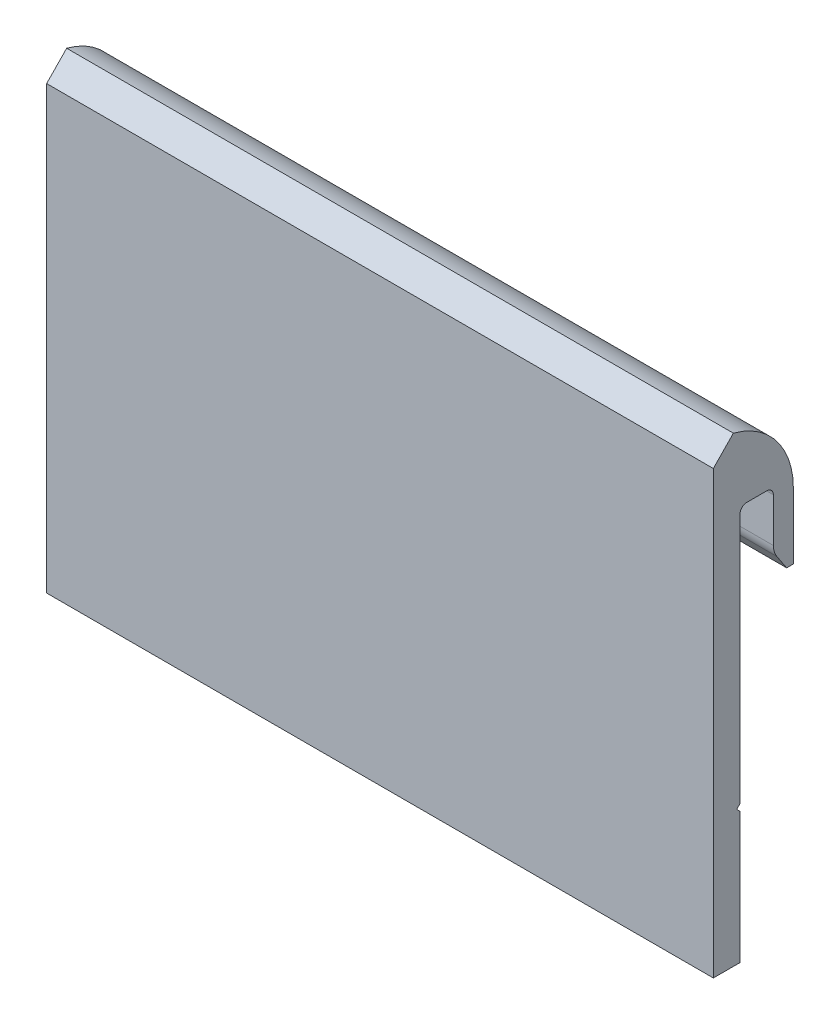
ISO-10303-21;
HEADER;
FILE_DESCRIPTION(('STEP AP214'),'2;1');
FILE_NAME('part.step','',(''),(''),'','','');
FILE_SCHEMA(('AUTOMOTIVE_DESIGN { 1 0 10303 214 1 1 1 1 }'));
ENDSEC;
DATA;
#1=APPLICATION_CONTEXT('core data for automotive mechanical design processes');
#2=APPLICATION_PROTOCOL_DEFINITION('international standard','automotive_design',2000,#1);
#3=PRODUCT_CONTEXT('',#1,'mechanical');
#4=PRODUCT('Part','Part','',(#3));
#5=PRODUCT_RELATED_PRODUCT_CATEGORY('part','',(#4));
#6=PRODUCT_DEFINITION_FORMATION('','',#4);
#7=PRODUCT_DEFINITION_CONTEXT('part definition',#1,'design');
#8=PRODUCT_DEFINITION('design','',#6,#7);
#9=PRODUCT_DEFINITION_SHAPE('','',#8);
#10=(LENGTH_UNIT() NAMED_UNIT(*) SI_UNIT(.MILLI.,.METRE.));
#11=(NAMED_UNIT(*) PLANE_ANGLE_UNIT() SI_UNIT($,.RADIAN.));
#12=(NAMED_UNIT(*) SI_UNIT($,.STERADIAN.) SOLID_ANGLE_UNIT());
#13=UNCERTAINTY_MEASURE_WITH_UNIT(LENGTH_MEASURE(1.E-05),#10,'distance_accuracy_value','');
#14=(GEOMETRIC_REPRESENTATION_CONTEXT(3) GLOBAL_UNCERTAINTY_ASSIGNED_CONTEXT((#13)) GLOBAL_UNIT_ASSIGNED_CONTEXT((#10,
#11,#12)) REPRESENTATION_CONTEXT('',''));
#15=CARTESIAN_POINT('',(0.,0.,0.));
#16=DIRECTION('',(0.,0.,1.));
#17=DIRECTION('',(1.,0.,0.));
#18=AXIS2_PLACEMENT_3D('',#15,#16,#17);
#19=CARTESIAN_POINT('',(-50.,130.205977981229,-0.821931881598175));
#20=DIRECTION('',(0.,0.,-1.));
#21=DIRECTION('',(0.,1.,0.));
#22=AXIS2_PLACEMENT_3D('',#19,#20,#21);
#23=PLANE('',#22);
#24=DIRECTION('',(0.,1.,0.));
#25=VECTOR('',#24,1.);
#26=CARTESIAN_POINT('',(50.,130.205977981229,-0.821931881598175));
#27=LINE('',#26,#25);
#28=CARTESIAN_POINT('',(50.,64.0209864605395,-0.821931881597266));
#29=VERTEX_POINT('',#28);
#30=CARTESIAN_POINT('',(50.,130.205977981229,-0.821931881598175));
#31=VERTEX_POINT('',#30);
#32=EDGE_CURVE('E176',#29,#31,#27,.T.);
#33=ORIENTED_EDGE('',*,*,#32,.T.);
#34=DIRECTION('',(1.,0.,0.));
#35=VECTOR('',#34,1.);
#36=CARTESIAN_POINT('',(-50.,130.205977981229,-0.821931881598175));
#37=LINE('',#36,#35);
#38=CARTESIAN_POINT('',(-50.,130.205977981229,-0.821931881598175));
#39=VERTEX_POINT('',#38);
#40=EDGE_CURVE('E11',#39,#31,#37,.T.);
#41=ORIENTED_EDGE('',*,*,#40,.F.);
#42=DIRECTION('',(0.,1.,0.));
#43=VECTOR('',#42,1.);
#44=CARTESIAN_POINT('',(-50.,130.205977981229,-0.821931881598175));
#45=LINE('',#44,#43);
#46=CARTESIAN_POINT('',(-50.,64.0209864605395,-0.821931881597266));
#47=VERTEX_POINT('',#46);
#48=EDGE_CURVE('E206',#47,#39,#45,.T.);
#49=ORIENTED_EDGE('',*,*,#48,.F.);
#50=DIRECTION('',(1.,0.,0.));
#51=VECTOR('',#50,1.);
#52=CARTESIAN_POINT('',(-50.,64.0209864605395,-0.821931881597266));
#53=LINE('',#52,#51);
#54=EDGE_CURVE('E172',#47,#29,#53,.T.);
#55=ORIENTED_EDGE('',*,*,#54,.T.);
#56=EDGE_LOOP('',(#33,#41,#49,#55));
#57=FACE_BOUND('',#56,.T.);
#58=ADVANCED_FACE('F32',(#57),#23,.F.);
#59=CARTESIAN_POINT('',(-50.,133.294066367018,-3.82193188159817));
#60=DIRECTION('',(0.,-0.69680273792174,-0.717262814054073));
#61=DIRECTION('',(0.,0.717262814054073,-0.69680273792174));
#62=AXIS2_PLACEMENT_3D('',#59,#60,#61);
#63=PLANE('',#62);
#64=DIRECTION('',(0.,0.717262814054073,-0.69680273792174));
#65=VECTOR('',#64,1.);
#66=CARTESIAN_POINT('',(50.,133.294066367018,-3.82193188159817));
#67=LINE('',#66,#65);
#68=CARTESIAN_POINT('',(50.,133.294066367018,-3.82193188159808));
#69=VERTEX_POINT('',#68);
#70=EDGE_CURVE('E179',#31,#69,#67,.T.);
#71=ORIENTED_EDGE('',*,*,#70,.T.);
#72=DIRECTION('',(1.,0.,0.));
#73=VECTOR('',#72,1.);
#74=CARTESIAN_POINT('',(-50.,133.294066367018,-3.82193188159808));
#75=LINE('',#74,#73);
#76=CARTESIAN_POINT('',(-50.,133.294066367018,-3.82193188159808));
#77=VERTEX_POINT('',#76);
#78=EDGE_CURVE('E40',#77,#69,#75,.T.);
#79=ORIENTED_EDGE('',*,*,#78,.F.);
#80=DIRECTION('',(0.,0.717262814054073,-0.69680273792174));
#81=VECTOR('',#80,1.);
#82=CARTESIAN_POINT('',(-50.,133.294066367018,-3.82193188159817));
#83=LINE('',#82,#81);
#84=EDGE_CURVE('E115',#39,#77,#83,.T.);
#85=ORIENTED_EDGE('',*,*,#84,.F.);
#86=ORIENTED_EDGE('',*,*,#40,.T.);
#87=EDGE_LOOP('',(#71,#79,#85,#86));
#88=FACE_BOUND('',#87,.T.);
#89=ADVANCED_FACE('F304',(#88),#63,.F.);
#90=CARTESIAN_POINT('',(-50.,121.675116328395,-0.821931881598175));
#91=DIRECTION('',(1.,0.,0.));
#92=DIRECTION('',(0.,0.,-1.));
#93=AXIS2_PLACEMENT_3D('',#90,#91,#92);
#94=CYLINDRICAL_SURFACE('',#93,12.0000000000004);
#95=CARTESIAN_POINT('',(50.,121.675116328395,-0.821931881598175));
#96=DIRECTION('',(-1.,0.,0.));
#97=DIRECTION('',(0.,0.,1.));
#98=AXIS2_PLACEMENT_3D('',#95,#96,#97);
#99=CIRCLE('',#98,12.0000000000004);
#100=CARTESIAN_POINT('',(50.,121.675116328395,-12.8219318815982));
#101=VERTEX_POINT('',#100);
#102=EDGE_CURVE('E181',#69,#101,#99,.T.);
#103=ORIENTED_EDGE('',*,*,#102,.T.);
#104=DIRECTION('',(1.,0.,0.));
#105=VECTOR('',#104,1.);
#106=CARTESIAN_POINT('',(-50.,121.675116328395,-12.8219318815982));
#107=LINE('',#106,#105);
#108=CARTESIAN_POINT('',(-50.,121.675116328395,-12.8219318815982));
#109=VERTEX_POINT('',#108);
#110=EDGE_CURVE('E237',#109,#101,#107,.T.);
#111=ORIENTED_EDGE('',*,*,#110,.F.);
#112=CARTESIAN_POINT('',(-50.,121.675116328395,-0.821931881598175));
#113=DIRECTION('',(-1.,0.,0.));
#114=DIRECTION('',(0.,0.,1.));
#115=AXIS2_PLACEMENT_3D('',#112,#113,#114);
#116=CIRCLE('',#115,12.0000000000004);
#117=EDGE_CURVE('E245',#77,#109,#116,.T.);
#118=ORIENTED_EDGE('',*,*,#117,.F.);
#119=ORIENTED_EDGE('',*,*,#78,.T.);
#120=EDGE_LOOP('',(#103,#111,#118,#119));
#121=FACE_BOUND('',#120,.T.);
#122=ADVANCED_FACE('F243',(#121),#94,.T.);
#123=CARTESIAN_POINT('',(-50.,121.675116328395,-12.8219318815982));
#124=DIRECTION('',(0.,0.,1.));
#125=DIRECTION('',(1.,0.,0.));
#126=AXIS2_PLACEMENT_3D('',#123,#124,#125);
#127=PLANE('',#126);
#128=DIRECTION('',(0.,-1.,0.));
#129=VECTOR('',#128,1.);
#130=CARTESIAN_POINT('',(50.,121.675116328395,-12.8219318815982));
#131=LINE('',#130,#129);
#132=CARTESIAN_POINT('',(50.,111.794066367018,-12.8219318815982));
#133=VERTEX_POINT('',#132);
#134=EDGE_CURVE('E183',#101,#133,#131,.T.);
#135=ORIENTED_EDGE('',*,*,#134,.T.);
#136=DIRECTION('',(1.,0.,0.));
#137=VECTOR('',#136,1.);
#138=CARTESIAN_POINT('',(-50.,111.794066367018,-12.8219318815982));
#139=LINE('',#138,#137);
#140=CARTESIAN_POINT('',(-50.,111.794066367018,-12.8219318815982));
#141=VERTEX_POINT('',#140);
#142=EDGE_CURVE('E234',#141,#133,#139,.T.);
#143=ORIENTED_EDGE('',*,*,#142,.F.);
#144=DIRECTION('',(0.,-1.,0.));
#145=VECTOR('',#144,1.);
#146=CARTESIAN_POINT('',(-50.,121.675116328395,-12.8219318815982));
#147=LINE('',#146,#145);
#148=EDGE_CURVE('E263',#109,#141,#147,.T.);
#149=ORIENTED_EDGE('',*,*,#148,.F.);
#150=ORIENTED_EDGE('',*,*,#110,.T.);
#151=EDGE_LOOP('',(#135,#143,#149,#150));
#152=FACE_BOUND('',#151,.T.);
#153=ADVANCED_FACE('F254',(#152),#127,.F.);
#154=CARTESIAN_POINT('',(-50.,111.794066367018,-12.8219318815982));
#155=DIRECTION('',(0.,1.,0.));
#156=DIRECTION('',(0.,0.,1.));
#157=AXIS2_PLACEMENT_3D('',#154,#155,#156);
#158=PLANE('',#157);
#159=DIRECTION('',(0.,0.,1.));
#160=VECTOR('',#159,1.);
#161=CARTESIAN_POINT('',(50.,111.794066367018,-12.8219318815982));
#162=LINE('',#161,#160);
#163=CARTESIAN_POINT('',(50.,111.794066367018,-11.8219318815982));
#164=VERTEX_POINT('',#163);
#165=EDGE_CURVE('E185',#133,#164,#162,.T.);
#166=ORIENTED_EDGE('',*,*,#165,.T.);
#167=DIRECTION('',(1.,0.,0.));
#168=VECTOR('',#167,1.);
#169=CARTESIAN_POINT('',(-50.,111.794066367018,-11.8219318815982));
#170=LINE('',#169,#168);
#171=CARTESIAN_POINT('',(-50.,111.794066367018,-11.8219318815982));
#172=VERTEX_POINT('',#171);
#173=EDGE_CURVE('E231',#172,#164,#170,.T.);
#174=ORIENTED_EDGE('',*,*,#173,.F.);
#175=DIRECTION('',(0.,0.,1.));
#176=VECTOR('',#175,1.);
#177=CARTESIAN_POINT('',(-50.,111.794066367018,-12.8219318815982));
#178=LINE('',#177,#176);
#179=EDGE_CURVE('E260',#141,#172,#178,.T.);
#180=ORIENTED_EDGE('',*,*,#179,.F.);
#181=ORIENTED_EDGE('',*,*,#142,.T.);
#182=EDGE_LOOP('',(#166,#174,#180,#181));
#183=FACE_BOUND('',#182,.T.);
#184=ADVANCED_FACE('F258',(#183),#158,.F.);
#185=CARTESIAN_POINT('',(-50.,111.794066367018,-11.8219318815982));
#186=DIRECTION('',(0.,0.554700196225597,-0.832050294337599));
#187=DIRECTION('',(0.,0.832050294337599,0.554700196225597));
#188=AXIS2_PLACEMENT_3D('',#185,#186,#187);
#189=PLANE('',#188);
#190=DIRECTION('',(0.,0.832050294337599,0.554700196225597));
#191=VECTOR('',#190,1.);
#192=CARTESIAN_POINT('',(50.,111.794066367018,-11.8219318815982));
#193=LINE('',#192,#191);
#194=CARTESIAN_POINT('',(50.,114.038292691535,-10.3257809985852));
#195=VERTEX_POINT('',#194);
#196=EDGE_CURVE('E187',#164,#195,#193,.T.);
#197=ORIENTED_EDGE('',*,*,#196,.T.);
#198=DIRECTION('',(1.,0.,0.));
#199=VECTOR('',#198,1.);
#200=CARTESIAN_POINT('',(-50.,114.038292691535,-10.3257809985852));
#201=LINE('',#200,#199);
#202=CARTESIAN_POINT('',(-50.,114.038292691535,-10.3257809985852));
#203=VERTEX_POINT('',#202);
#204=EDGE_CURVE('E228',#203,#195,#201,.T.);
#205=ORIENTED_EDGE('',*,*,#204,.F.);
#206=DIRECTION('',(0.,0.832050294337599,0.554700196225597));
#207=VECTOR('',#206,1.);
#208=CARTESIAN_POINT('',(-50.,111.794066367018,-11.8219318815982));
#209=LINE('',#208,#207);
#210=EDGE_CURVE('E262',#172,#203,#209,.T.);
#211=ORIENTED_EDGE('',*,*,#210,.F.);
#212=ORIENTED_EDGE('',*,*,#173,.T.);
#213=EDGE_LOOP('',(#197,#205,#211,#212));
#214=FACE_BOUND('',#213,.T.);
#215=ADVANCED_FACE('F317',(#214),#189,.F.);
#216=CARTESIAN_POINT('',(-50.,115.702393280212,-12.8219318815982));
#217=DIRECTION('',(1.,0.,0.));
#218=DIRECTION('',(0.,0.,-1.));
#219=AXIS2_PLACEMENT_3D('',#216,#217,#218);
#220=CYLINDRICAL_SURFACE('',#219,3.);
#221=CARTESIAN_POINT('',(50.,115.702393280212,-12.8219318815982));
#222=DIRECTION('',(-1.,0.,0.));
#223=DIRECTION('',(0.,0.,1.));
#224=AXIS2_PLACEMENT_3D('',#221,#222,#223);
#225=CIRCLE('',#224,3.);
#226=CARTESIAN_POINT('',(50.,115.702393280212,-9.82193188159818));
#227=VERTEX_POINT('',#226);
#228=EDGE_CURVE('E189',#195,#227,#225,.T.);
#229=ORIENTED_EDGE('',*,*,#228,.T.);
#230=DIRECTION('',(1.,0.,0.));
#231=VECTOR('',#230,1.);
#232=CARTESIAN_POINT('',(-50.,115.702393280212,-9.82193188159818));
#233=LINE('',#232,#231);
#234=CARTESIAN_POINT('',(-50.,115.702393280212,-9.82193188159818));
#235=VERTEX_POINT('',#234);
#236=EDGE_CURVE('E225',#235,#227,#233,.T.);
#237=ORIENTED_EDGE('',*,*,#236,.F.);
#238=CARTESIAN_POINT('',(-50.,115.702393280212,-12.8219318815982));
#239=DIRECTION('',(-1.,0.,0.));
#240=DIRECTION('',(0.,0.,1.));
#241=AXIS2_PLACEMENT_3D('',#238,#239,#240);
#242=CIRCLE('',#241,3.);
#243=EDGE_CURVE('E265',#203,#235,#242,.T.);
#244=ORIENTED_EDGE('',*,*,#243,.F.);
#245=ORIENTED_EDGE('',*,*,#204,.T.);
#246=EDGE_LOOP('',(#229,#237,#244,#245));
#247=FACE_BOUND('',#246,.T.);
#248=ADVANCED_FACE('F320',(#247),#220,.T.);
#249=CARTESIAN_POINT('',(-50.,122.294066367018,-9.82193188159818));
#250=DIRECTION('',(0.,0.,-1.));
#251=DIRECTION('',(-1.,0.,0.));
#252=AXIS2_PLACEMENT_3D('',#249,#250,#251);
#253=PLANE('',#252);
#254=DIRECTION('',(0.,1.,0.));
#255=VECTOR('',#254,1.);
#256=CARTESIAN_POINT('',(50.,122.294066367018,-9.82193188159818));
#257=LINE('',#256,#255);
#258=CARTESIAN_POINT('',(50.,122.294066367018,-9.82193188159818));
#259=VERTEX_POINT('',#258);
#260=EDGE_CURVE('E191',#227,#259,#257,.T.);
#261=ORIENTED_EDGE('',*,*,#260,.T.);
#262=DIRECTION('',(1.,0.,0.));
#263=VECTOR('',#262,1.);
#264=CARTESIAN_POINT('',(-50.,122.294066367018,-9.82193188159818));
#265=LINE('',#264,#263);
#266=CARTESIAN_POINT('',(-50.,122.294066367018,-9.82193188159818));
#267=VERTEX_POINT('',#266);
#268=EDGE_CURVE('E222',#267,#259,#265,.T.);
#269=ORIENTED_EDGE('',*,*,#268,.F.);
#270=DIRECTION('',(0.,1.,0.));
#271=VECTOR('',#270,1.);
#272=CARTESIAN_POINT('',(-50.,122.294066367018,-9.82193188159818));
#273=LINE('',#272,#271);
#274=EDGE_CURVE('E271',#235,#267,#273,.T.);
#275=ORIENTED_EDGE('',*,*,#274,.F.);
#276=ORIENTED_EDGE('',*,*,#236,.T.);
#277=EDGE_LOOP('',(#261,#269,#275,#276));
#278=FACE_BOUND('',#277,.T.);
#279=ADVANCED_FACE('F324',(#278),#253,.F.);
#280=CARTESIAN_POINT('',(-50.,122.294066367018,-8.82193188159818));
#281=DIRECTION('',(1.,0.,0.));
#282=DIRECTION('',(0.,0.,-1.));
#283=AXIS2_PLACEMENT_3D('',#280,#281,#282);
#284=CYLINDRICAL_SURFACE('',#283,1.);
#285=CARTESIAN_POINT('',(50.,122.294066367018,-8.82193188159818));
#286=DIRECTION('',(1.,0.,0.));
#287=DIRECTION('',(0.,0.,1.));
#288=AXIS2_PLACEMENT_3D('',#285,#286,#287);
#289=CIRCLE('',#288,1.);
#290=CARTESIAN_POINT('',(50.,123.294066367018,-8.82193188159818));
#291=VERTEX_POINT('',#290);
#292=EDGE_CURVE('E193',#259,#291,#289,.T.);
#293=ORIENTED_EDGE('',*,*,#292,.T.);
#294=DIRECTION('',(1.,0.,0.));
#295=VECTOR('',#294,1.);
#296=CARTESIAN_POINT('',(-50.,123.294066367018,-8.82193188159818));
#297=LINE('',#296,#295);
#298=CARTESIAN_POINT('',(-50.,123.294066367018,-8.82193188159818));
#299=VERTEX_POINT('',#298);
#300=EDGE_CURVE('E219',#299,#291,#297,.T.);
#301=ORIENTED_EDGE('',*,*,#300,.F.);
#302=CARTESIAN_POINT('',(-50.,122.294066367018,-8.82193188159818));
#303=DIRECTION('',(1.,0.,0.));
#304=DIRECTION('',(0.,0.,1.));
#305=AXIS2_PLACEMENT_3D('',#302,#303,#304);
#306=CIRCLE('',#305,1.);
#307=EDGE_CURVE('E273',#267,#299,#306,.T.);
#308=ORIENTED_EDGE('',*,*,#307,.F.);
#309=ORIENTED_EDGE('',*,*,#268,.T.);
#310=EDGE_LOOP('',(#293,#301,#308,#309));
#311=FACE_BOUND('',#310,.T.);
#312=ADVANCED_FACE('F328',(#311),#284,.F.);
#313=CARTESIAN_POINT('',(-50.,123.294066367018,-5.82193188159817));
#314=DIRECTION('',(0.,1.,0.));
#315=DIRECTION('',(0.,0.,1.));
#316=AXIS2_PLACEMENT_3D('',#313,#314,#315);
#317=PLANE('',#316);
#318=DIRECTION('',(0.,0.,1.));
#319=VECTOR('',#318,1.);
#320=CARTESIAN_POINT('',(50.,123.294066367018,-5.82193188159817));
#321=LINE('',#320,#319);
#322=CARTESIAN_POINT('',(50.,123.294066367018,-5.82193188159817));
#323=VERTEX_POINT('',#322);
#324=EDGE_CURVE('E195',#291,#323,#321,.T.);
#325=ORIENTED_EDGE('',*,*,#324,.T.);
#326=DIRECTION('',(1.,0.,0.));
#327=VECTOR('',#326,1.);
#328=CARTESIAN_POINT('',(-50.,123.294066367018,-5.82193188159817));
#329=LINE('',#328,#327);
#330=CARTESIAN_POINT('',(-50.,123.294066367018,-5.82193188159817));
#331=VERTEX_POINT('',#330);
#332=EDGE_CURVE('E216',#331,#323,#329,.T.);
#333=ORIENTED_EDGE('',*,*,#332,.F.);
#334=DIRECTION('',(0.,0.,1.));
#335=VECTOR('',#334,1.);
#336=CARTESIAN_POINT('',(-50.,123.294066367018,-5.82193188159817));
#337=LINE('',#336,#335);
#338=EDGE_CURVE('E275',#299,#331,#337,.T.);
#339=ORIENTED_EDGE('',*,*,#338,.F.);
#340=ORIENTED_EDGE('',*,*,#300,.T.);
#341=EDGE_LOOP('',(#325,#333,#339,#340));
#342=FACE_BOUND('',#341,.T.);
#343=ADVANCED_FACE('F332',(#342),#317,.F.);
#344=CARTESIAN_POINT('',(-50.,122.294066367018,-5.82193188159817));
#345=DIRECTION('',(1.,0.,0.));
#346=DIRECTION('',(0.,0.,-1.));
#347=AXIS2_PLACEMENT_3D('',#344,#345,#346);
#348=CYLINDRICAL_SURFACE('',#347,1.);
#349=CARTESIAN_POINT('',(50.,122.294066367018,-5.82193188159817));
#350=DIRECTION('',(1.,0.,0.));
#351=DIRECTION('',(0.,0.,1.));
#352=AXIS2_PLACEMENT_3D('',#349,#350,#351);
#353=CIRCLE('',#352,1.);
#354=CARTESIAN_POINT('',(50.,122.294066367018,-4.82193188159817));
#355=VERTEX_POINT('',#354);
#356=EDGE_CURVE('E197',#323,#355,#353,.T.);
#357=ORIENTED_EDGE('',*,*,#356,.T.);
#358=DIRECTION('',(1.,0.,0.));
#359=VECTOR('',#358,1.);
#360=CARTESIAN_POINT('',(-50.,122.294066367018,-4.82193188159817));
#361=LINE('',#360,#359);
#362=CARTESIAN_POINT('',(-50.,122.294066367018,-4.82193188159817));
#363=VERTEX_POINT('',#362);
#364=EDGE_CURVE('E213',#363,#355,#361,.T.);
#365=ORIENTED_EDGE('',*,*,#364,.F.);
#366=CARTESIAN_POINT('',(-50.,122.294066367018,-5.82193188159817));
#367=DIRECTION('',(1.,0.,0.));
#368=DIRECTION('',(0.,0.,1.));
#369=AXIS2_PLACEMENT_3D('',#366,#367,#368);
#370=CIRCLE('',#369,1.);
#371=EDGE_CURVE('E277',#331,#363,#370,.T.);
#372=ORIENTED_EDGE('',*,*,#371,.F.);
#373=ORIENTED_EDGE('',*,*,#332,.T.);
#374=EDGE_LOOP('',(#357,#365,#372,#373));
#375=FACE_BOUND('',#374,.T.);
#376=ADVANCED_FACE('F336',(#375),#348,.F.);
#377=CARTESIAN_POINT('',(-50.,84.675116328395,-4.82193188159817));
#378=DIRECTION('',(0.,0.,1.));
#379=DIRECTION('',(1.,0.,0.));
#380=AXIS2_PLACEMENT_3D('',#377,#378,#379);
#381=PLANE('',#380);
#382=DIRECTION('',(0.,-1.,0.));
#383=VECTOR('',#382,1.);
#384=CARTESIAN_POINT('',(50.,84.675116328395,-4.82193188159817));
#385=LINE('',#384,#383);
#386=CARTESIAN_POINT('',(50.,84.675116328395,-4.82193188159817));
#387=VERTEX_POINT('',#386);
#388=EDGE_CURVE('E199',#355,#387,#385,.T.);
#389=ORIENTED_EDGE('',*,*,#388,.T.);
#390=DIRECTION('',(1.,0.,0.));
#391=VECTOR('',#390,1.);
#392=CARTESIAN_POINT('',(-50.,84.675116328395,-4.82193188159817));
#393=LINE('',#392,#391);
#394=CARTESIAN_POINT('',(-50.,84.675116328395,-4.82193188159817));
#395=VERTEX_POINT('',#394);
#396=EDGE_CURVE('E210',#395,#387,#393,.T.);
#397=ORIENTED_EDGE('',*,*,#396,.F.);
#398=DIRECTION('',(0.,-1.,0.));
#399=VECTOR('',#398,1.);
#400=CARTESIAN_POINT('',(-50.,84.675116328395,-4.82193188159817));
#401=LINE('',#400,#399);
#402=EDGE_CURVE('E279',#363,#395,#401,.T.);
#403=ORIENTED_EDGE('',*,*,#402,.F.);
#404=ORIENTED_EDGE('',*,*,#364,.T.);
#405=EDGE_LOOP('',(#389,#397,#403,#404));
#406=FACE_BOUND('',#405,.T.);
#407=ADVANCED_FACE('F285',(#406),#381,.F.);
#408=CARTESIAN_POINT('',(-50.,84.675116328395,-4.82193188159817));
#409=DIRECTION('',(0.,0.707106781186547,0.707106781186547));
#410=DIRECTION('',(0.,-0.707106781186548,0.707106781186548));
#411=AXIS2_PLACEMENT_3D('',#408,#409,#410);
#412=PLANE('',#411);
#413=DIRECTION('',(0.,-0.707106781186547,0.707106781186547));
#414=VECTOR('',#413,1.);
#415=CARTESIAN_POINT('',(50.,84.675116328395,-4.82193188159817));
#416=LINE('',#415,#414);
#417=CARTESIAN_POINT('',(50.,84.175116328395,-4.32193188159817));
#418=VERTEX_POINT('',#417);
#419=EDGE_CURVE('E201',#387,#418,#416,.T.);
#420=ORIENTED_EDGE('',*,*,#419,.T.);
#421=DIRECTION('',(1.,0.,0.));
#422=VECTOR('',#421,1.);
#423=CARTESIAN_POINT('',(-50.,84.175116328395,-4.32193188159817));
#424=LINE('',#423,#422);
#425=CARTESIAN_POINT('',(-50.,84.175116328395,-4.32193188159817));
#426=VERTEX_POINT('',#425);
#427=EDGE_CURVE('E167',#426,#418,#424,.T.);
#428=ORIENTED_EDGE('',*,*,#427,.F.);
#429=DIRECTION('',(0.,-0.707106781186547,0.707106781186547));
#430=VECTOR('',#429,1.);
#431=CARTESIAN_POINT('',(-50.,84.675116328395,-4.82193188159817));
#432=LINE('',#431,#430);
#433=EDGE_CURVE('E158',#395,#426,#432,.T.);
#434=ORIENTED_EDGE('',*,*,#433,.F.);
#435=ORIENTED_EDGE('',*,*,#396,.T.);
#436=EDGE_LOOP('',(#420,#428,#434,#435));
#437=FACE_BOUND('',#436,.T.);
#438=ADVANCED_FACE('F289',(#437),#412,.F.);
#439=CARTESIAN_POINT('',(-50.,84.175116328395,-4.32193188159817));
#440=DIRECTION('',(0.,-0.707106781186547,0.707106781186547));
#441=DIRECTION('',(0.,-0.707106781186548,-0.707106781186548));
#442=AXIS2_PLACEMENT_3D('',#439,#440,#441);
#443=PLANE('',#442);
#444=DIRECTION('',(0.,-0.707106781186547,-0.707106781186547));
#445=VECTOR('',#444,1.);
#446=CARTESIAN_POINT('',(50.,84.175116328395,-4.32193188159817));
#447=LINE('',#446,#445);
#448=CARTESIAN_POINT('',(50.,83.675116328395,-4.82193188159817));
#449=VERTEX_POINT('',#448);
#450=EDGE_CURVE('E166',#418,#449,#447,.T.);
#451=ORIENTED_EDGE('',*,*,#450,.T.);
#452=DIRECTION('',(1.,0.,0.));
#453=VECTOR('',#452,1.);
#454=CARTESIAN_POINT('',(-50.,83.675116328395,-4.82193188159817));
#455=LINE('',#454,#453);
#456=CARTESIAN_POINT('',(-50.,83.675116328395,-4.82193188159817));
#457=VERTEX_POINT('',#456);
#458=EDGE_CURVE('E163',#457,#449,#455,.T.);
#459=ORIENTED_EDGE('',*,*,#458,.F.);
#460=DIRECTION('',(0.,-0.707106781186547,-0.707106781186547));
#461=VECTOR('',#460,1.);
#462=CARTESIAN_POINT('',(-50.,84.175116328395,-4.32193188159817));
#463=LINE('',#462,#461);
#464=EDGE_CURVE('E152',#426,#457,#463,.T.);
#465=ORIENTED_EDGE('',*,*,#464,.F.);
#466=ORIENTED_EDGE('',*,*,#427,.T.);
#467=EDGE_LOOP('',(#451,#459,#465,#466));
#468=FACE_BOUND('',#467,.T.);
#469=ADVANCED_FACE('F164',(#468),#443,.F.);
#470=CARTESIAN_POINT('',(-50.,83.675116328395,-4.82193188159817));
#471=DIRECTION('',(0.,0.,1.));
#472=DIRECTION('',(1.,0.,0.));
#473=AXIS2_PLACEMENT_3D('',#470,#471,#472);
#474=PLANE('',#473);
#475=DIRECTION('',(0.,-1.,0.));
#476=VECTOR('',#475,1.);
#477=CARTESIAN_POINT('',(50.,83.675116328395,-4.82193188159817));
#478=LINE('',#477,#476);
#479=CARTESIAN_POINT('',(50.,64.0209864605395,-4.82193188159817));
#480=VERTEX_POINT('',#479);
#481=EDGE_CURVE('E101',#449,#480,#478,.T.);
#482=ORIENTED_EDGE('',*,*,#481,.T.);
#483=DIRECTION('',(1.,0.,0.));
#484=VECTOR('',#483,1.);
#485=CARTESIAN_POINT('',(-50.,64.0209864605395,-4.82193188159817));
#486=LINE('',#485,#484);
#487=CARTESIAN_POINT('',(-50.,64.0209864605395,-4.82193188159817));
#488=VERTEX_POINT('',#487);
#489=EDGE_CURVE('E168',#488,#480,#486,.T.);
#490=ORIENTED_EDGE('',*,*,#489,.F.);
#491=DIRECTION('',(0.,-1.,0.));
#492=VECTOR('',#491,1.);
#493=CARTESIAN_POINT('',(-50.,83.675116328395,-4.82193188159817));
#494=LINE('',#493,#492);
#495=EDGE_CURVE('E156',#457,#488,#494,.T.);
#496=ORIENTED_EDGE('',*,*,#495,.F.);
#497=ORIENTED_EDGE('',*,*,#458,.T.);
#498=EDGE_LOOP('',(#482,#490,#496,#497));
#499=FACE_BOUND('',#498,.T.);
#500=ADVANCED_FACE('F170',(#499),#474,.F.);
#501=CARTESIAN_POINT('',(-50.,64.0209864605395,-0.821931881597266));
#502=DIRECTION('',(0.,1.,0.));
#503=DIRECTION('',(0.,0.,1.));
#504=AXIS2_PLACEMENT_3D('',#501,#502,#503);
#505=PLANE('',#504);
#506=DIRECTION('',(0.,0.,1.));
#507=VECTOR('',#506,1.);
#508=CARTESIAN_POINT('',(50.,64.0209864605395,-0.821931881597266));
#509=LINE('',#508,#507);
#510=EDGE_CURVE('E107',#480,#29,#509,.T.);
#511=ORIENTED_EDGE('',*,*,#510,.T.);
#512=ORIENTED_EDGE('',*,*,#54,.F.);
#513=DIRECTION('',(0.,0.,1.));
#514=VECTOR('',#513,1.);
#515=CARTESIAN_POINT('',(-50.,64.0209864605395,-0.821931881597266));
#516=LINE('',#515,#514);
#517=EDGE_CURVE('E48',#488,#47,#516,.T.);
#518=ORIENTED_EDGE('',*,*,#517,.F.);
#519=ORIENTED_EDGE('',*,*,#489,.T.);
#520=EDGE_LOOP('',(#511,#512,#518,#519));
#521=FACE_BOUND('',#520,.T.);
#522=ADVANCED_FACE('F293',(#521),#505,.F.);
#523=CARTESIAN_POINT('',(-50.,122.294066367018,-5.82193188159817));
#524=DIRECTION('',(-1.,0.,0.));
#525=DIRECTION('',(0.,0.,1.));
#526=AXIS2_PLACEMENT_3D('',#523,#524,#525);
#527=PLANE('',#526);
#528=ORIENTED_EDGE('',*,*,#48,.T.);
#529=ORIENTED_EDGE('',*,*,#84,.T.);
#530=ORIENTED_EDGE('',*,*,#117,.T.);
#531=ORIENTED_EDGE('',*,*,#148,.T.);
#532=ORIENTED_EDGE('',*,*,#179,.T.);
#533=ORIENTED_EDGE('',*,*,#210,.T.);
#534=ORIENTED_EDGE('',*,*,#243,.T.);
#535=ORIENTED_EDGE('',*,*,#274,.T.);
#536=ORIENTED_EDGE('',*,*,#307,.T.);
#537=ORIENTED_EDGE('',*,*,#338,.T.);
#538=ORIENTED_EDGE('',*,*,#371,.T.);
#539=ORIENTED_EDGE('',*,*,#402,.T.);
#540=ORIENTED_EDGE('',*,*,#433,.T.);
#541=ORIENTED_EDGE('',*,*,#464,.T.);
#542=ORIENTED_EDGE('',*,*,#495,.T.);
#543=ORIENTED_EDGE('',*,*,#517,.T.);
#544=EDGE_LOOP('',(#528,#529,#530,#531,#532,#533,#534,#535,#536,#537,#538,#539,#540,#541,#542,#543));
#545=FACE_BOUND('',#544,.T.);
#546=ADVANCED_FACE('F154',(#545),#527,.T.);
#547=CARTESIAN_POINT('',(50.,122.294066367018,-5.82193188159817));
#548=DIRECTION('',(-1.,0.,0.));
#549=DIRECTION('',(0.,0.,1.));
#550=AXIS2_PLACEMENT_3D('',#547,#548,#549);
#551=PLANE('',#550);
#552=ORIENTED_EDGE('',*,*,#32,.F.);
#553=ORIENTED_EDGE('',*,*,#510,.F.);
#554=ORIENTED_EDGE('',*,*,#481,.F.);
#555=ORIENTED_EDGE('',*,*,#450,.F.);
#556=ORIENTED_EDGE('',*,*,#419,.F.);
#557=ORIENTED_EDGE('',*,*,#388,.F.);
#558=ORIENTED_EDGE('',*,*,#356,.F.);
#559=ORIENTED_EDGE('',*,*,#324,.F.);
#560=ORIENTED_EDGE('',*,*,#292,.F.);
#561=ORIENTED_EDGE('',*,*,#260,.F.);
#562=ORIENTED_EDGE('',*,*,#228,.F.);
#563=ORIENTED_EDGE('',*,*,#196,.F.);
#564=ORIENTED_EDGE('',*,*,#165,.F.);
#565=ORIENTED_EDGE('',*,*,#134,.F.);
#566=ORIENTED_EDGE('',*,*,#102,.F.);
#567=ORIENTED_EDGE('',*,*,#70,.F.);
#568=EDGE_LOOP('',(#552,#553,#554,#555,#556,#557,#558,#559,#560,#561,#562,#563,#564,#565,#566,#567));
#569=FACE_BOUND('',#568,.T.);
#570=ADVANCED_FACE('F249',(#569),#551,.F.);
#571=CLOSED_SHELL('',(#58,#89,#122,#153,#184,#215,#248,#279,#312,#343,#376,#407,#438,#469,#500,
#522,#546,#570));
#572=MANIFOLD_SOLID_BREP('B2',#571);
#573=ADVANCED_BREP_SHAPE_REPRESENTATION('',(#18,#572),#14);
#574=SHAPE_DEFINITION_REPRESENTATION(#9,#573);
ENDSEC;
END-ISO-10303-21;
